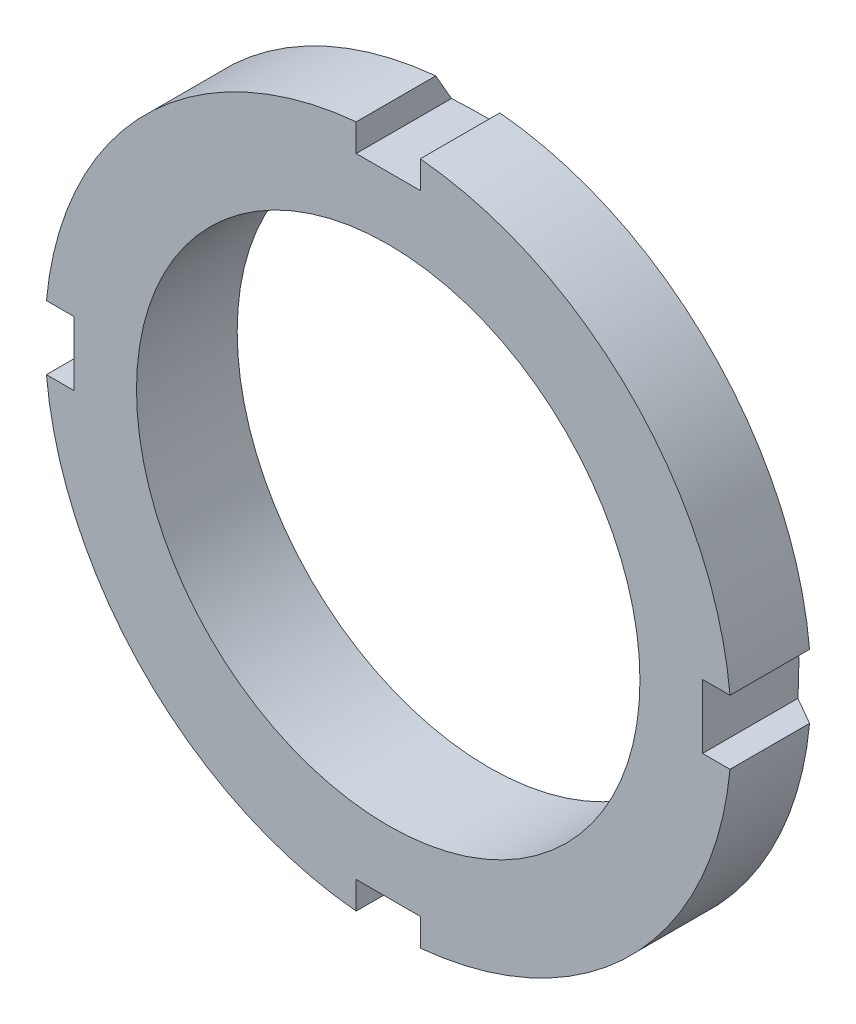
ISO-10303-21;
HEADER;
FILE_DESCRIPTION(('STEP AP214'),'2;1');
FILE_NAME('part.step','',(''),(''),'','','');
FILE_SCHEMA(('AUTOMOTIVE_DESIGN { 1 0 10303 214 1 1 1 1 }'));
ENDSEC;
DATA;
#1=APPLICATION_CONTEXT('core data for automotive mechanical design processes');
#2=APPLICATION_PROTOCOL_DEFINITION('international standard','automotive_design',2000,#1);
#3=PRODUCT_CONTEXT('',#1,'mechanical');
#4=PRODUCT('Part','Part','',(#3));
#5=PRODUCT_RELATED_PRODUCT_CATEGORY('part','',(#4));
#6=PRODUCT_DEFINITION_FORMATION('','',#4);
#7=PRODUCT_DEFINITION_CONTEXT('part definition',#1,'design');
#8=PRODUCT_DEFINITION('design','',#6,#7);
#9=PRODUCT_DEFINITION_SHAPE('','',#8);
#10=(LENGTH_UNIT() NAMED_UNIT(*) SI_UNIT(.MILLI.,.METRE.));
#11=(NAMED_UNIT(*) PLANE_ANGLE_UNIT() SI_UNIT($,.RADIAN.));
#12=(NAMED_UNIT(*) SI_UNIT($,.STERADIAN.) SOLID_ANGLE_UNIT());
#13=UNCERTAINTY_MEASURE_WITH_UNIT(LENGTH_MEASURE(1.E-05),#10,'distance_accuracy_value','');
#14=(GEOMETRIC_REPRESENTATION_CONTEXT(3) GLOBAL_UNCERTAINTY_ASSIGNED_CONTEXT((#13)) GLOBAL_UNIT_ASSIGNED_CONTEXT((#10,
#11,#12)) REPRESENTATION_CONTEXT('',''));
#15=CARTESIAN_POINT('',(0.,0.,0.));
#16=DIRECTION('',(0.,0.,1.));
#17=DIRECTION('',(1.,0.,0.));
#18=AXIS2_PLACEMENT_3D('',#15,#16,#17);
#19=CARTESIAN_POINT('',(0.,0.,0.));
#20=DIRECTION('',(0.,0.,-1.));
#21=DIRECTION('',(-1.,0.,0.));
#22=AXIS2_PLACEMENT_3D('',#19,#20,#21);
#23=CYLINDRICAL_SURFACE('',#22,37.5);
#24=DIRECTION('',(0.,0.,-1.));
#25=VECTOR('',#24,1.);
#26=CARTESIAN_POINT('',(-3.5,37.3363094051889,11.));
#27=LINE('',#26,#25);
#28=CARTESIAN_POINT('',(-3.5,37.3363094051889,11.));
#29=VERTEX_POINT('',#28);
#30=CARTESIAN_POINT('',(-3.5,37.3363094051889,2.30940107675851));
#31=VERTEX_POINT('',#30);
#32=EDGE_CURVE('E149',#29,#31,#27,.T.);
#33=ORIENTED_EDGE('',*,*,#32,.T.);
#34=CARTESIAN_POINT('',(0.,0.,2.30940107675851));
#35=DIRECTION('',(0.,0.,-1.));
#36=DIRECTION('',(-1.,0.,0.));
#37=AXIS2_PLACEMENT_3D('',#34,#35,#36);
#38=CIRCLE('',#37,37.5);
#39=CARTESIAN_POINT('',(-37.3363094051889,3.5,2.30940107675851));
#40=VERTEX_POINT('',#39);
#41=EDGE_CURVE('E186',#40,#31,#38,.T.);
#42=ORIENTED_EDGE('',*,*,#41,.F.);
#43=DIRECTION('',(0.,0.,-1.));
#44=VECTOR('',#43,1.);
#45=CARTESIAN_POINT('',(-37.3363094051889,3.5,11.));
#46=LINE('',#45,#44);
#47=CARTESIAN_POINT('',(-37.3363094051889,3.5,11.));
#48=VERTEX_POINT('',#47);
#49=EDGE_CURVE('E162',#48,#40,#46,.T.);
#50=ORIENTED_EDGE('',*,*,#49,.F.);
#51=CARTESIAN_POINT('',(0.,0.,11.));
#52=DIRECTION('',(0.,0.,-1.));
#53=DIRECTION('',(-1.,0.,0.));
#54=AXIS2_PLACEMENT_3D('',#51,#52,#53);
#55=CIRCLE('',#54,37.5);
#56=EDGE_CURVE('E169',#48,#29,#55,.T.);
#57=ORIENTED_EDGE('',*,*,#56,.T.);
#58=EDGE_LOOP('',(#33,#42,#50,#57));
#59=FACE_BOUND('',#58,.T.);
#60=ADVANCED_FACE('F33',(#59),#23,.T.);
#61=DIRECTION('',(0.,0.,-1.));
#62=VECTOR('',#61,1.);
#63=CARTESIAN_POINT('',(-37.3363094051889,-3.49999999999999,11.));
#64=LINE('',#63,#62);
#65=CARTESIAN_POINT('',(-37.3363094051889,-3.49999999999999,11.));
#66=VERTEX_POINT('',#65);
#67=CARTESIAN_POINT('',(-37.3363094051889,-3.5,2.30940107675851));
#68=VERTEX_POINT('',#67);
#69=EDGE_CURVE('E340',#66,#68,#64,.T.);
#70=ORIENTED_EDGE('',*,*,#69,.T.);
#71=CARTESIAN_POINT('',(-3.5,-37.3363094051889,2.30940107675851));
#72=VERTEX_POINT('',#71);
#73=EDGE_CURVE('E192',#72,#68,#38,.T.);
#74=ORIENTED_EDGE('',*,*,#73,.F.);
#75=DIRECTION('',(0.,0.,-1.));
#76=VECTOR('',#75,1.);
#77=CARTESIAN_POINT('',(-3.5,-37.3363094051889,11.));
#78=LINE('',#77,#76);
#79=CARTESIAN_POINT('',(-3.5,-37.3363094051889,11.));
#80=VERTEX_POINT('',#79);
#81=EDGE_CURVE('E314',#80,#72,#78,.T.);
#82=ORIENTED_EDGE('',*,*,#81,.F.);
#83=EDGE_CURVE('E179',#80,#66,#55,.T.);
#84=ORIENTED_EDGE('',*,*,#83,.T.);
#85=EDGE_LOOP('',(#70,#74,#82,#84));
#86=FACE_BOUND('',#85,.T.);
#87=ADVANCED_FACE('F395',(#86),#23,.T.);
#88=DIRECTION('',(0.,0.,-1.));
#89=VECTOR('',#88,1.);
#90=CARTESIAN_POINT('',(3.5,-37.3363094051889,11.));
#91=LINE('',#90,#89);
#92=CARTESIAN_POINT('',(3.5,-37.3363094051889,11.));
#93=VERTEX_POINT('',#92);
#94=CARTESIAN_POINT('',(3.5,-37.3363094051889,2.30940107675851));
#95=VERTEX_POINT('',#94);
#96=EDGE_CURVE('E330',#93,#95,#91,.T.);
#97=ORIENTED_EDGE('',*,*,#96,.T.);
#98=CARTESIAN_POINT('',(37.3363094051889,-3.5,2.30940107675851));
#99=VERTEX_POINT('',#98);
#100=EDGE_CURVE('E196',#99,#95,#38,.T.);
#101=ORIENTED_EDGE('',*,*,#100,.F.);
#102=DIRECTION('',(0.,0.,-1.));
#103=VECTOR('',#102,1.);
#104=CARTESIAN_POINT('',(37.3363094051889,-3.5,11.));
#105=LINE('',#104,#103);
#106=CARTESIAN_POINT('',(37.3363094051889,-3.5,11.));
#107=VERTEX_POINT('',#106);
#108=EDGE_CURVE('E328',#107,#99,#105,.T.);
#109=ORIENTED_EDGE('',*,*,#108,.F.);
#110=EDGE_CURVE('E183',#107,#93,#55,.T.);
#111=ORIENTED_EDGE('',*,*,#110,.T.);
#112=EDGE_LOOP('',(#97,#101,#109,#111));
#113=FACE_BOUND('',#112,.T.);
#114=ADVANCED_FACE('F327',(#113),#23,.T.);
#115=CARTESIAN_POINT('',(0.,0.,0.));
#116=DIRECTION('',(0.,0.,1.));
#117=DIRECTION('',(1.,0.,0.));
#118=AXIS2_PLACEMENT_3D('',#115,#116,#117);
#119=CONICAL_SURFACE('',#118,33.5,1.0471975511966);
#120=CARTESIAN_POINT('',(-43.0161307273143,3.5,5.57621303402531));
#121=CARTESIAN_POINT('',(-41.9810825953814,3.5,4.98059975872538));
#122=CARTESIAN_POINT('',(-40.9459765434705,3.5,4.38508710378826));
#123=CARTESIAN_POINT('',(-38.8756108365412,3.5,3.19432914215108));
#124=CARTESIAN_POINT('',(-37.8403511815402,3.5,2.5990838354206));
#125=CARTESIAN_POINT('',(-35.7696402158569,3.5,1.40892651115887));
#126=CARTESIAN_POINT('',(-34.7341889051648,3.5,0.814014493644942));
#127=CARTESIAN_POINT('',(-32.6630313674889,3.5,-0.375365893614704));
#128=CARTESIAN_POINT('',(-31.6273251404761,3.5,-0.969834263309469));
#129=CARTESIAN_POINT('',(-30.5914599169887,3.5,-1.56402557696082));
#130=B_SPLINE_CURVE_WITH_KNOTS('',3,(#120,#121,#122,#123,#124,#125,#126,#127,#128,#129),
.UNSPECIFIED.,.F.,.F.,(4,2,2,2,4),(0.,3.58255752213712,7.16511463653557,10.7476719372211,
14.3302296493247),.UNSPECIFIED.);
#131=CARTESIAN_POINT('',(-34.3363094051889,3.5,0.585566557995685));
#132=VERTEX_POINT('',#131);
#133=EDGE_CURVE('E235',#40,#132,#130,.T.);
#134=ORIENTED_EDGE('',*,*,#133,.F.);
#135=ORIENTED_EDGE('',*,*,#41,.T.);
#136=CARTESIAN_POINT('',(-3.5,28.3999857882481,-2.82044718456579));
#137=CARTESIAN_POINT('',(-3.5,29.4361144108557,-2.22671506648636));
#138=CARTESIAN_POINT('',(-3.5,30.4720463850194,-1.63263997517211));
#139=CARTESIAN_POINT('',(-3.5,32.5435987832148,-0.443947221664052));
#140=CARTESIAN_POINT('',(-3.5,33.5792192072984,0.150670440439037));
#141=CARTESIAN_POINT('',(-3.5,35.6502305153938,1.34030511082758));
#142=CARTESIAN_POINT('',(-3.5,36.6856213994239,1.935322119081));
#143=CARTESIAN_POINT('',(-3.5,38.7562213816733,3.12567275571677));
#144=CARTESIAN_POINT('',(-3.5,39.7914304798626,3.72100638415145));
#145=CARTESIAN_POINT('',(-3.5,40.826572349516,4.31645683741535));
#146=B_SPLINE_CURVE_WITH_KNOTS('',3,(#136,#137,#138,#139,#140,#141,#142,#143,#144,#145),
.UNSPECIFIED.,.F.,.F.,(4,2,2,2,4),(0.,3.58255797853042,7.16511535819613,10.7476724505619,
14.3302301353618),.UNSPECIFIED.);
#147=CARTESIAN_POINT('',(-3.5,34.3363094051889,0.585566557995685));
#148=VERTEX_POINT('',#147);
#149=EDGE_CURVE('E156',#148,#31,#146,.T.);
#150=ORIENTED_EDGE('',*,*,#149,.F.);
#151=CARTESIAN_POINT('',(11.7892823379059,34.3363094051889,1.61880193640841));
#152=CARTESIAN_POINT('',(11.1912515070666,34.3363094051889,1.50666255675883));
#153=CARTESIAN_POINT('',(10.5918088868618,34.3363094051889,1.40192016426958));
#154=CARTESIAN_POINT('',(9.39033927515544,34.3363094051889,1.20812451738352));
#155=CARTESIAN_POINT('',(8.78831204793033,34.3363094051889,1.11907272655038));
#156=CARTESIAN_POINT('',(7.58175696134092,34.3363094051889,0.957538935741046));
#157=CARTESIAN_POINT('',(6.97722811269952,34.3363094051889,0.88506429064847));
#158=CARTESIAN_POINT('',(5.76635058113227,34.3363094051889,0.757511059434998));
#159=CARTESIAN_POINT('',(5.16000195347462,34.3363094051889,0.702431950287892));
#160=CARTESIAN_POINT('',(3.95375504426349,34.3363094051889,0.610887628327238));
#161=CARTESIAN_POINT('',(3.35387432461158,34.3363094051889,0.574191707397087));
#162=CARTESIAN_POINT('',(2.15328381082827,34.3363094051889,0.518782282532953));
#163=CARTESIAN_POINT('',(1.55257402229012,34.3363094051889,0.500068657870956));
#164=CARTESIAN_POINT('',(0.351026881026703,34.3363094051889,0.480848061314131));
#165=CARTESIAN_POINT('',(-0.249810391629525,34.3363094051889,0.480336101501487));
#166=CARTESIAN_POINT('',(-1.45122219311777,34.3363094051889,0.497512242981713));
#167=CARTESIAN_POINT('',(-2.05179672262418,34.3363094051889,0.515200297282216));
#168=CARTESIAN_POINT('',(-3.25124663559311,34.3363094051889,0.568526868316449));
#169=CARTESIAN_POINT('',(-3.85012321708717,34.3363094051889,0.604138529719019));
#170=CARTESIAN_POINT('',(-5.04657261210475,34.3363094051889,0.692887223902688));
#171=CARTESIAN_POINT('',(-5.64414542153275,34.3363094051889,0.746024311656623));
#172=CARTESIAN_POINT('',(-6.83773000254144,34.3363094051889,0.869256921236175));
#173=CARTESIAN_POINT('',(-7.43374121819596,34.3363094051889,0.939357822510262));
#174=CARTESIAN_POINT('',(-8.62364124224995,34.3363094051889,1.09577109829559));
#175=CARTESIAN_POINT('',(-9.21752993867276,34.3363094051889,1.18208431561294));
#176=CARTESIAN_POINT('',(-11.011138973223,34.3363094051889,1.46657601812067));
#177=CARTESIAN_POINT('',(-12.2071508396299,34.3363094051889,1.68865570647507));
#178=CARTESIAN_POINT('',(-13.9917376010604,34.3363094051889,2.06315396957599));
#179=CARTESIAN_POINT('',(-14.5848093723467,34.3363094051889,2.19482657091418));
#180=CARTESIAN_POINT('',(-15.7679069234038,34.3363094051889,2.47096933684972));
#181=CARTESIAN_POINT('',(-16.3579330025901,34.3363094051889,2.61543821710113));
#182=CARTESIAN_POINT('',(-16.9464686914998,34.3363094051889,2.76581572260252));
#183=B_SPLINE_CURVE_WITH_KNOTS('',3,(#151,#152,#153,#154,#155,#156,#157,#158,#159,#160,#161,
#162,#163,#164,#165,#166,#167,#168,#169,#170,#171,#172,#173,#174,#175,#176,#177,#178,#179,#180,
#181,#182),.UNSPECIFIED.,.F.,.F.,(4,2,2,2,2,2,2,2,2,2,2,2,2,2,2,4),(0.,1.82535120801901,
3.65087258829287,5.47720234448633,7.30347718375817,9.10621914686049,10.9089490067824,
12.7111848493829,14.5134160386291,16.3129549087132,18.11249942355,19.9126153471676,
21.7128248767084,25.3603999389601,27.1828334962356,29.0050843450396),.UNSPECIFIED.);
#184=CARTESIAN_POINT('',(3.5,34.3363094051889,0.585566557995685));
#185=VERTEX_POINT('',#184);
#186=EDGE_CURVE('E249',#185,#148,#183,.T.);
#187=ORIENTED_EDGE('',*,*,#186,.F.);
#188=CARTESIAN_POINT('',(3.5,40.826572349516,4.31645683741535));
#189=CARTESIAN_POINT('',(3.5,39.7914304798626,3.72100638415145));
#190=CARTESIAN_POINT('',(3.5,38.7562213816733,3.12567275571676));
#191=CARTESIAN_POINT('',(3.5,36.6856213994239,1.935322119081));
#192=CARTESIAN_POINT('',(3.5,35.6502305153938,1.34030511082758));
#193=CARTESIAN_POINT('',(3.5,33.5792192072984,0.150670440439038));
#194=CARTESIAN_POINT('',(3.5,32.5435987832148,-0.443947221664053));
#195=CARTESIAN_POINT('',(3.5,30.4720463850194,-1.63263997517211));
#196=CARTESIAN_POINT('',(3.5,29.4361144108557,-2.22671506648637));
#197=CARTESIAN_POINT('',(3.5,28.3999857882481,-2.82044718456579));
#198=B_SPLINE_CURVE_WITH_KNOTS('',3,(#188,#189,#190,#191,#192,#193,#194,#195,#196,#197),
.UNSPECIFIED.,.F.,.F.,(4,2,2,2,4),(0.,3.5825576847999,7.16511477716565,10.7476721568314,
14.3302301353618),.UNSPECIFIED.);
#199=CARTESIAN_POINT('',(3.5,37.3363094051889,2.30940107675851));
#200=VERTEX_POINT('',#199);
#201=EDGE_CURVE('E161',#200,#185,#198,.T.);
#202=ORIENTED_EDGE('',*,*,#201,.F.);
#203=CARTESIAN_POINT('',(37.3363094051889,3.5,2.30940107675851));
#204=VERTEX_POINT('',#203);
#205=EDGE_CURVE('E191',#200,#204,#38,.T.);
#206=ORIENTED_EDGE('',*,*,#205,.T.);
#207=CARTESIAN_POINT('',(28.3999857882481,3.5,-2.82044718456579));
#208=CARTESIAN_POINT('',(29.4361144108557,3.5,-2.22671506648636));
#209=CARTESIAN_POINT('',(30.4720463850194,3.5,-1.63263997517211));
#210=CARTESIAN_POINT('',(32.5435987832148,3.5,-0.443947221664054));
#211=CARTESIAN_POINT('',(33.5792192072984,3.5,0.150670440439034));
#212=CARTESIAN_POINT('',(35.6502305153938,3.5,1.34030511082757));
#213=CARTESIAN_POINT('',(36.6856213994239,3.5,1.935322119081));
#214=CARTESIAN_POINT('',(38.7562213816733,3.5,3.12567275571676));
#215=CARTESIAN_POINT('',(39.7914304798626,3.5,3.72100638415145));
#216=CARTESIAN_POINT('',(40.826572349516,3.5,4.31645683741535));
#217=B_SPLINE_CURVE_WITH_KNOTS('',3,(#207,#208,#209,#210,#211,#212,#213,#214,#215,#216),
.UNSPECIFIED.,.F.,.F.,(4,2,2,2,4),(0.,3.58255797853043,7.16511535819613,10.7476724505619,
14.3302301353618),.UNSPECIFIED.);
#218=CARTESIAN_POINT('',(34.3363094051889,3.5,0.585566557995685));
#219=VERTEX_POINT('',#218);
#220=EDGE_CURVE('E275',#219,#204,#217,.T.);
#221=ORIENTED_EDGE('',*,*,#220,.F.);
#222=CARTESIAN_POINT('',(34.3363094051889,-16.9464686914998,2.76581572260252));
#223=CARTESIAN_POINT('',(34.3363094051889,-16.3579330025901,2.61543821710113));
#224=CARTESIAN_POINT('',(34.3363094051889,-15.7679069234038,2.47096933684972));
#225=CARTESIAN_POINT('',(34.3363094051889,-14.5848093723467,2.19482657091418));
#226=CARTESIAN_POINT('',(34.3363094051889,-13.9917376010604,2.06315396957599));
#227=CARTESIAN_POINT('',(34.3363094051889,-12.20715083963,1.68865570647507));
#228=CARTESIAN_POINT('',(34.3363094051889,-11.011138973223,1.46657601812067));
#229=CARTESIAN_POINT('',(34.3363094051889,-9.21752993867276,1.18208431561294));
#230=CARTESIAN_POINT('',(34.3363094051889,-8.62364124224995,1.09577109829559));
#231=CARTESIAN_POINT('',(34.3363094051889,-7.43374121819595,0.939357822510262));
#232=CARTESIAN_POINT('',(34.3363094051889,-6.83773000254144,0.869256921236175));
#233=CARTESIAN_POINT('',(34.3363094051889,-5.64414542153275,0.746024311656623));
#234=CARTESIAN_POINT('',(34.3363094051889,-5.04657261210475,0.692887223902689));
#235=CARTESIAN_POINT('',(34.3363094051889,-3.85012321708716,0.604138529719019));
#236=CARTESIAN_POINT('',(34.3363094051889,-3.2512466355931,0.568526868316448));
#237=CARTESIAN_POINT('',(34.3363094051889,-2.05179672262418,0.515200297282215));
#238=CARTESIAN_POINT('',(34.3363094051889,-1.45122219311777,0.497512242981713));
#239=CARTESIAN_POINT('',(34.3363094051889,-0.249810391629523,0.480336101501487));
#240=CARTESIAN_POINT('',(34.3363094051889,0.351026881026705,0.480848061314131));
#241=CARTESIAN_POINT('',(34.3363094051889,1.55257402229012,0.500068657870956));
#242=CARTESIAN_POINT('',(34.3363094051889,2.15328381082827,0.518782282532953));
#243=CARTESIAN_POINT('',(34.3363094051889,3.35387432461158,0.574191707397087));
#244=CARTESIAN_POINT('',(34.3363094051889,3.95375504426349,0.610887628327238));
#245=CARTESIAN_POINT('',(34.3363094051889,5.16000195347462,0.702431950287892));
#246=CARTESIAN_POINT('',(34.3363094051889,5.76635058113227,0.757511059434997));
#247=CARTESIAN_POINT('',(34.3363094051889,6.97722811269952,0.88506429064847));
#248=CARTESIAN_POINT('',(34.3363094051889,7.58175696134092,0.957538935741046));
#249=CARTESIAN_POINT('',(34.3363094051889,8.78831204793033,1.11907272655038));
#250=CARTESIAN_POINT('',(34.3363094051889,9.39033927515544,1.20812451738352));
#251=CARTESIAN_POINT('',(34.3363094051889,10.5918088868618,1.40192016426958));
#252=CARTESIAN_POINT('',(34.3363094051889,11.1912515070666,1.50666255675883));
#253=CARTESIAN_POINT('',(34.3363094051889,11.7892823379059,1.61880193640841));
#254=B_SPLINE_CURVE_WITH_KNOTS('',3,(#222,#223,#224,#225,#226,#227,#228,#229,#230,#231,#232,
#233,#234,#235,#236,#237,#238,#239,#240,#241,#242,#243,#244,#245,#246,#247,#248,#249,#250,#251,
#252,#253),.UNSPECIFIED.,.F.,.F.,(4,2,2,2,2,2,2,2,2,2,2,2,2,2,2,4),(0.,1.82225084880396,
3.64468440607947,7.29225946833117,9.09246899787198,10.8925849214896,12.6921294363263,
14.4916683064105,16.2938994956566,18.0961353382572,19.8988651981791,21.7016071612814,
23.5278820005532,25.3542117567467,27.1797331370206,29.0050843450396),.UNSPECIFIED.);
#255=CARTESIAN_POINT('',(34.3363094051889,-3.5,0.585566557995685));
#256=VERTEX_POINT('',#255);
#257=EDGE_CURVE('E207',#256,#219,#254,.T.);
#258=ORIENTED_EDGE('',*,*,#257,.F.);
#259=CARTESIAN_POINT('',(40.826572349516,-3.5,4.31645683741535));
#260=CARTESIAN_POINT('',(39.7914304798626,-3.5,3.72100638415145));
#261=CARTESIAN_POINT('',(38.7562213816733,-3.5,3.12567275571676));
#262=CARTESIAN_POINT('',(36.6856213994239,-3.5,1.935322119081));
#263=CARTESIAN_POINT('',(35.6502305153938,-3.5,1.34030511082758));
#264=CARTESIAN_POINT('',(33.5792192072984,-3.5,0.150670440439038));
#265=CARTESIAN_POINT('',(32.5435987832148,-3.5,-0.443947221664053));
#266=CARTESIAN_POINT('',(30.4720463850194,-3.5,-1.63263997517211));
#267=CARTESIAN_POINT('',(29.4361144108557,-3.5,-2.22671506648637));
#268=CARTESIAN_POINT('',(28.3999857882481,-3.5,-2.82044718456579));
#269=B_SPLINE_CURVE_WITH_KNOTS('',3,(#259,#260,#261,#262,#263,#264,#265,#266,#267,#268),
.UNSPECIFIED.,.F.,.F.,(4,2,2,2,4),(0.,3.5825576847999,7.16511477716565,10.7476721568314,
14.3302301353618),.UNSPECIFIED.);
#270=EDGE_CURVE('E281',#99,#256,#269,.T.);
#271=ORIENTED_EDGE('',*,*,#270,.F.);
#272=ORIENTED_EDGE('',*,*,#100,.T.);
#273=CARTESIAN_POINT('',(3.5,-30.5914599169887,-1.56402557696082));
#274=CARTESIAN_POINT('',(3.5,-31.6273251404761,-0.969834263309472));
#275=CARTESIAN_POINT('',(3.5,-32.6630313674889,-0.375365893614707));
#276=CARTESIAN_POINT('',(3.5,-34.7341889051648,0.814014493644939));
#277=CARTESIAN_POINT('',(3.5,-35.7696402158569,1.40892651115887));
#278=CARTESIAN_POINT('',(3.5,-37.8403511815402,2.5990838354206));
#279=CARTESIAN_POINT('',(3.5,-38.8756108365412,3.19432914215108));
#280=CARTESIAN_POINT('',(3.5,-40.9459765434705,4.38508710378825));
#281=CARTESIAN_POINT('',(3.5,-41.9810825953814,4.98059975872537));
#282=CARTESIAN_POINT('',(3.5,-43.0161307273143,5.57621303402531));
#283=B_SPLINE_CURVE_WITH_KNOTS('',3,(#273,#274,#275,#276,#277,#278,#279,#280,#281,#282),
.UNSPECIFIED.,.F.,.F.,(4,2,2,2,4),(0.,3.58255771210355,7.16511501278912,10.7476721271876,
14.3302296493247),.UNSPECIFIED.);
#284=CARTESIAN_POINT('',(3.5,-34.3363094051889,0.585566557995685));
#285=VERTEX_POINT('',#284);
#286=EDGE_CURVE('E57',#285,#95,#283,.T.);
#287=ORIENTED_EDGE('',*,*,#286,.F.);
#288=CARTESIAN_POINT('',(-16.9464686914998,-34.3363094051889,2.76581572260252));
#289=CARTESIAN_POINT('',(-16.3579330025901,-34.3363094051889,2.61543821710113));
#290=CARTESIAN_POINT('',(-15.7679069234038,-34.3363094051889,2.47096933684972));
#291=CARTESIAN_POINT('',(-14.5848093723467,-34.3363094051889,2.19482657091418));
#292=CARTESIAN_POINT('',(-13.9917376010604,-34.3363094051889,2.06315396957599));
#293=CARTESIAN_POINT('',(-12.20715083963,-34.3363094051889,1.68865570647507));
#294=CARTESIAN_POINT('',(-11.011138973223,-34.3363094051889,1.46657601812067));
#295=CARTESIAN_POINT('',(-9.21752993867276,-34.3363094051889,1.18208431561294));
#296=CARTESIAN_POINT('',(-8.62364124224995,-34.3363094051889,1.09577109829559));
#297=CARTESIAN_POINT('',(-7.43374121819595,-34.3363094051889,0.939357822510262));
#298=CARTESIAN_POINT('',(-6.83773000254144,-34.3363094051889,0.869256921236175));
#299=CARTESIAN_POINT('',(-5.64414542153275,-34.3363094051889,0.746024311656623));
#300=CARTESIAN_POINT('',(-5.04657261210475,-34.3363094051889,0.692887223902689));
#301=CARTESIAN_POINT('',(-3.85012321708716,-34.3363094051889,0.604138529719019));
#302=CARTESIAN_POINT('',(-3.2512466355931,-34.3363094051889,0.568526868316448));
#303=CARTESIAN_POINT('',(-2.05179672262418,-34.3363094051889,0.515200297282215));
#304=CARTESIAN_POINT('',(-1.45122219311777,-34.3363094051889,0.497512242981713));
#305=CARTESIAN_POINT('',(-0.249810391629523,-34.3363094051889,0.480336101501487));
#306=CARTESIAN_POINT('',(0.351026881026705,-34.3363094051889,0.480848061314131));
#307=CARTESIAN_POINT('',(1.55257402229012,-34.3363094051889,0.500068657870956));
#308=CARTESIAN_POINT('',(2.15328381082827,-34.3363094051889,0.518782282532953));
#309=CARTESIAN_POINT('',(3.35387432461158,-34.3363094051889,0.574191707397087));
#310=CARTESIAN_POINT('',(3.95375504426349,-34.3363094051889,0.610887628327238));
#311=CARTESIAN_POINT('',(5.16000195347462,-34.3363094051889,0.702431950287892));
#312=CARTESIAN_POINT('',(5.76635058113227,-34.3363094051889,0.757511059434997));
#313=CARTESIAN_POINT('',(6.97722811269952,-34.3363094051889,0.88506429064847));
#314=CARTESIAN_POINT('',(7.58175696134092,-34.3363094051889,0.957538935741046));
#315=CARTESIAN_POINT('',(8.78831204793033,-34.3363094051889,1.11907272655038));
#316=CARTESIAN_POINT('',(9.39033927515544,-34.3363094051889,1.20812451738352));
#317=CARTESIAN_POINT('',(10.5918088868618,-34.3363094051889,1.40192016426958));
#318=CARTESIAN_POINT('',(11.1912515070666,-34.3363094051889,1.50666255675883));
#319=CARTESIAN_POINT('',(11.7892823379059,-34.3363094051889,1.61880193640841));
#320=B_SPLINE_CURVE_WITH_KNOTS('',3,(#288,#289,#290,#291,#292,#293,#294,#295,#296,#297,#298,
#299,#300,#301,#302,#303,#304,#305,#306,#307,#308,#309,#310,#311,#312,#313,#314,#315,#316,#317,
#318,#319),.UNSPECIFIED.,.F.,.F.,(4,2,2,2,2,2,2,2,2,2,2,2,2,2,2,4),(0.,1.82225084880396,
3.64468440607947,7.29225946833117,9.09246899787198,10.8925849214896,12.6921294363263,
14.4916683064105,16.2938994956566,18.0961353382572,19.8988651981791,21.7016071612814,
23.5278820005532,25.3542117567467,27.1797331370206,29.0050843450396),.UNSPECIFIED.);
#321=CARTESIAN_POINT('',(-3.5,-34.3363094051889,0.585566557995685));
#322=VERTEX_POINT('',#321);
#323=EDGE_CURVE('E203',#322,#285,#320,.T.);
#324=ORIENTED_EDGE('',*,*,#323,.F.);
#325=CARTESIAN_POINT('',(-3.5,-43.0161307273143,5.57621303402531));
#326=CARTESIAN_POINT('',(-3.5,-41.9810825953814,4.98059975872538));
#327=CARTESIAN_POINT('',(-3.5,-40.9459765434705,4.38508710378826));
#328=CARTESIAN_POINT('',(-3.5,-38.8756108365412,3.19432914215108));
#329=CARTESIAN_POINT('',(-3.5,-37.8403511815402,2.5990838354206));
#330=CARTESIAN_POINT('',(-3.5,-35.7696402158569,1.40892651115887));
#331=CARTESIAN_POINT('',(-3.5,-34.7341889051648,0.814014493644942));
#332=CARTESIAN_POINT('',(-3.5,-32.6630313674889,-0.375365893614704));
#333=CARTESIAN_POINT('',(-3.5,-31.6273251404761,-0.969834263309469));
#334=CARTESIAN_POINT('',(-3.5,-30.5914599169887,-1.56402557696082));
#335=B_SPLINE_CURVE_WITH_KNOTS('',3,(#325,#326,#327,#328,#329,#330,#331,#332,#333,#334),
.UNSPECIFIED.,.F.,.F.,(4,2,2,2,4),(0.,3.58255752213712,7.16511463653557,10.7476719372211,
14.3302296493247),.UNSPECIFIED.);
#336=EDGE_CURVE('E307',#72,#322,#335,.T.);
#337=ORIENTED_EDGE('',*,*,#336,.F.);
#338=ORIENTED_EDGE('',*,*,#73,.T.);
#339=CARTESIAN_POINT('',(-30.5914599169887,-3.5,-1.56402557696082));
#340=CARTESIAN_POINT('',(-31.6273251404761,-3.5,-0.969834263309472));
#341=CARTESIAN_POINT('',(-32.6630313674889,-3.5,-0.375365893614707));
#342=CARTESIAN_POINT('',(-34.7341889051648,-3.5,0.814014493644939));
#343=CARTESIAN_POINT('',(-35.7696402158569,-3.5,1.40892651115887));
#344=CARTESIAN_POINT('',(-37.8403511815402,-3.5,2.5990838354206));
#345=CARTESIAN_POINT('',(-38.8756108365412,-3.5,3.19432914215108));
#346=CARTESIAN_POINT('',(-40.9459765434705,-3.5,4.38508710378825));
#347=CARTESIAN_POINT('',(-41.9810825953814,-3.5,4.98059975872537));
#348=CARTESIAN_POINT('',(-43.0161307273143,-3.5,5.57621303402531));
#349=B_SPLINE_CURVE_WITH_KNOTS('',3,(#339,#340,#341,#342,#343,#344,#345,#346,#347,#348),
.UNSPECIFIED.,.F.,.F.,(4,2,2,2,4),(0.,3.58255771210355,7.16511501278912,10.7476721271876,
14.3302296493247),.UNSPECIFIED.);
#350=CARTESIAN_POINT('',(-34.3363094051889,-3.5,0.585566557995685));
#351=VERTEX_POINT('',#350);
#352=EDGE_CURVE('E49',#351,#68,#349,.T.);
#353=ORIENTED_EDGE('',*,*,#352,.F.);
#354=CARTESIAN_POINT('',(-34.3363094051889,11.7892823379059,1.61880193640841));
#355=CARTESIAN_POINT('',(-34.3363094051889,11.1912515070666,1.50666255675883));
#356=CARTESIAN_POINT('',(-34.3363094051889,10.5918088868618,1.40192016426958));
#357=CARTESIAN_POINT('',(-34.3363094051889,9.39033927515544,1.20812451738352));
#358=CARTESIAN_POINT('',(-34.3363094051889,8.78831204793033,1.11907272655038));
#359=CARTESIAN_POINT('',(-34.3363094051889,7.58175696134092,0.957538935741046));
#360=CARTESIAN_POINT('',(-34.3363094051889,6.97722811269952,0.88506429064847));
#361=CARTESIAN_POINT('',(-34.3363094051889,5.76635058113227,0.757511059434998));
#362=CARTESIAN_POINT('',(-34.3363094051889,5.16000195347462,0.702431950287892));
#363=CARTESIAN_POINT('',(-34.3363094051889,3.95375504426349,0.610887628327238));
#364=CARTESIAN_POINT('',(-34.3363094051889,3.35387432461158,0.574191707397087));
#365=CARTESIAN_POINT('',(-34.3363094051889,2.15328381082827,0.518782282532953));
#366=CARTESIAN_POINT('',(-34.3363094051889,1.55257402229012,0.500068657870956));
#367=CARTESIAN_POINT('',(-34.3363094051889,0.351026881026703,0.480848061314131));
#368=CARTESIAN_POINT('',(-34.3363094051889,-0.249810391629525,0.480336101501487));
#369=CARTESIAN_POINT('',(-34.3363094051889,-1.45122219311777,0.497512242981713));
#370=CARTESIAN_POINT('',(-34.3363094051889,-2.05179672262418,0.515200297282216));
#371=CARTESIAN_POINT('',(-34.3363094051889,-3.25124663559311,0.568526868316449));
#372=CARTESIAN_POINT('',(-34.3363094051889,-3.85012321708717,0.604138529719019));
#373=CARTESIAN_POINT('',(-34.3363094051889,-5.04657261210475,0.692887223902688));
#374=CARTESIAN_POINT('',(-34.3363094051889,-5.64414542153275,0.746024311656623));
#375=CARTESIAN_POINT('',(-34.3363094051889,-6.83773000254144,0.869256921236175));
#376=CARTESIAN_POINT('',(-34.3363094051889,-7.43374121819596,0.939357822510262));
#377=CARTESIAN_POINT('',(-34.3363094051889,-8.62364124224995,1.09577109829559));
#378=CARTESIAN_POINT('',(-34.3363094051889,-9.21752993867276,1.18208431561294));
#379=CARTESIAN_POINT('',(-34.3363094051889,-11.011138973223,1.46657601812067));
#380=CARTESIAN_POINT('',(-34.3363094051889,-12.2071508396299,1.68865570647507));
#381=CARTESIAN_POINT('',(-34.3363094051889,-13.9917376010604,2.06315396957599));
#382=CARTESIAN_POINT('',(-34.3363094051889,-14.5848093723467,2.19482657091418));
#383=CARTESIAN_POINT('',(-34.3363094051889,-15.7679069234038,2.47096933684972));
#384=CARTESIAN_POINT('',(-34.3363094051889,-16.3579330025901,2.61543821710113));
#385=CARTESIAN_POINT('',(-34.3363094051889,-16.9464686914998,2.76581572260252));
#386=B_SPLINE_CURVE_WITH_KNOTS('',3,(#354,#355,#356,#357,#358,#359,#360,#361,#362,#363,#364,
#365,#366,#367,#368,#369,#370,#371,#372,#373,#374,#375,#376,#377,#378,#379,#380,#381,#382,#383,
#384,#385),.UNSPECIFIED.,.F.,.F.,(4,2,2,2,2,2,2,2,2,2,2,2,2,2,2,4),(0.,1.82535120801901,
3.65087258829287,5.47720234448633,7.30347718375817,9.10621914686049,10.9089490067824,
12.7111848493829,14.5134160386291,16.3129549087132,18.11249942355,19.9126153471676,
21.7128248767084,25.3603999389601,27.1828334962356,29.0050843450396),.UNSPECIFIED.);
#387=EDGE_CURVE('E199',#132,#351,#386,.T.);
#388=ORIENTED_EDGE('',*,*,#387,.F.);
#389=EDGE_LOOP('',(#134,#135,#150,#187,#202,#206,#221,#258,#271,#272,#287,#324,#337,#338,#353,#388));
#390=FACE_BOUND('',#389,.T.);
#391=CARTESIAN_POINT('',(0.,0.,0.));
#392=DIRECTION('',(0.,0.,-1.));
#393=DIRECTION('',(-1.,0.,0.));
#394=AXIS2_PLACEMENT_3D('',#391,#392,#393);
#395=CIRCLE('',#394,33.5);
#396=CARTESIAN_POINT('',(-33.5,0.,0.));
#397=VERTEX_POINT('',#396);
#398=EDGE_CURVE('E11',#397,#397,#395,.T.);
#399=ORIENTED_EDGE('',*,*,#398,.F.);
#400=EDGE_LOOP('',(#399));
#401=FACE_BOUND('',#400,.T.);
#402=ADVANCED_FACE('F35',(#390,#401),#119,.T.);
#403=CARTESIAN_POINT('',(0.,27.5,0.));
#404=DIRECTION('',(0.,0.,-1.));
#405=DIRECTION('',(-1.,0.,0.));
#406=AXIS2_PLACEMENT_3D('',#403,#404,#405);
#407=PLANE('',#406);
#408=ORIENTED_EDGE('',*,*,#398,.T.);
#409=EDGE_LOOP('',(#408));
#410=FACE_BOUND('',#409,.T.);
#411=CARTESIAN_POINT('',(0.,0.,0.));
#412=DIRECTION('',(0.,0.,-1.));
#413=DIRECTION('',(-1.,0.,0.));
#414=AXIS2_PLACEMENT_3D('',#411,#412,#413);
#415=CIRCLE('',#414,27.5);
#416=CARTESIAN_POINT('',(-27.5,0.,0.));
#417=VERTEX_POINT('',#416);
#418=EDGE_CURVE('E42',#417,#417,#415,.T.);
#419=ORIENTED_EDGE('',*,*,#418,.F.);
#420=EDGE_LOOP('',(#419));
#421=FACE_BOUND('',#420,.T.);
#422=ADVANCED_FACE('F415',(#410,#421),#407,.T.);
#423=CARTESIAN_POINT('',(0.,0.,0.));
#424=DIRECTION('',(0.,0.,-1.));
#425=DIRECTION('',(-1.,0.,0.));
#426=AXIS2_PLACEMENT_3D('',#423,#424,#425);
#427=CYLINDRICAL_SURFACE('',#426,27.5);
#428=ORIENTED_EDGE('',*,*,#418,.T.);
#429=EDGE_LOOP('',(#428));
#430=FACE_BOUND('',#429,.T.);
#431=CARTESIAN_POINT('',(0.,0.,11.));
#432=DIRECTION('',(0.,0.,-1.));
#433=DIRECTION('',(-1.,0.,0.));
#434=AXIS2_PLACEMENT_3D('',#431,#432,#433);
#435=CIRCLE('',#434,27.5);
#436=CARTESIAN_POINT('',(-27.5,0.,11.));
#437=VERTEX_POINT('',#436);
#438=EDGE_CURVE('E176',#437,#437,#435,.T.);
#439=ORIENTED_EDGE('',*,*,#438,.F.);
#440=EDGE_LOOP('',(#439));
#441=FACE_BOUND('',#440,.T.);
#442=ADVANCED_FACE('F410',(#430,#441),#427,.F.);
#443=CARTESIAN_POINT('',(0.,37.5,11.));
#444=DIRECTION('',(0.,0.,1.));
#445=DIRECTION('',(1.,0.,0.));
#446=AXIS2_PLACEMENT_3D('',#443,#444,#445);
#447=PLANE('',#446);
#448=DIRECTION('',(1.,0.,0.));
#449=VECTOR('',#448,1.);
#450=CARTESIAN_POINT('',(-34.3363094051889,3.5,11.));
#451=LINE('',#450,#449);
#452=CARTESIAN_POINT('',(-34.3363094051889,3.5,11.));
#453=VERTEX_POINT('',#452);
#454=EDGE_CURVE('E173',#48,#453,#451,.T.);
#455=ORIENTED_EDGE('',*,*,#454,.T.);
#456=DIRECTION('',(0.,-1.,0.));
#457=VECTOR('',#456,1.);
#458=CARTESIAN_POINT('',(-34.3363094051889,3.5,11.));
#459=LINE('',#458,#457);
#460=CARTESIAN_POINT('',(-34.3363094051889,-3.5,11.));
#461=VERTEX_POINT('',#460);
#462=EDGE_CURVE('E347',#453,#461,#459,.T.);
#463=ORIENTED_EDGE('',*,*,#462,.T.);
#464=DIRECTION('',(-1.,0.,0.));
#465=VECTOR('',#464,1.);
#466=CARTESIAN_POINT('',(-34.3363094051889,-3.5,11.));
#467=LINE('',#466,#465);
#468=EDGE_CURVE('E349',#461,#66,#467,.T.);
#469=ORIENTED_EDGE('',*,*,#468,.T.);
#470=ORIENTED_EDGE('',*,*,#83,.F.);
#471=DIRECTION('',(0.,1.,0.));
#472=VECTOR('',#471,1.);
#473=CARTESIAN_POINT('',(-3.5,-34.3363094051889,11.));
#474=LINE('',#473,#472);
#475=CARTESIAN_POINT('',(-3.5,-34.3363094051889,11.));
#476=VERTEX_POINT('',#475);
#477=EDGE_CURVE('E354',#80,#476,#474,.T.);
#478=ORIENTED_EDGE('',*,*,#477,.T.);
#479=DIRECTION('',(1.,0.,0.));
#480=VECTOR('',#479,1.);
#481=CARTESIAN_POINT('',(-3.5,-34.3363094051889,11.));
#482=LINE('',#481,#480);
#483=CARTESIAN_POINT('',(3.5,-34.3363094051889,11.));
#484=VERTEX_POINT('',#483);
#485=EDGE_CURVE('E317',#476,#484,#482,.T.);
#486=ORIENTED_EDGE('',*,*,#485,.T.);
#487=DIRECTION('',(0.,-1.,0.));
#488=VECTOR('',#487,1.);
#489=CARTESIAN_POINT('',(3.5,-34.3363094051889,11.));
#490=LINE('',#489,#488);
#491=EDGE_CURVE('E357',#484,#93,#490,.T.);
#492=ORIENTED_EDGE('',*,*,#491,.T.);
#493=ORIENTED_EDGE('',*,*,#110,.F.);
#494=DIRECTION('',(-1.,0.,0.));
#495=VECTOR('',#494,1.);
#496=CARTESIAN_POINT('',(34.3363094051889,-3.5,11.));
#497=LINE('',#496,#495);
#498=CARTESIAN_POINT('',(34.3363094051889,-3.5,11.));
#499=VERTEX_POINT('',#498);
#500=EDGE_CURVE('E359',#107,#499,#497,.T.);
#501=ORIENTED_EDGE('',*,*,#500,.T.);
#502=DIRECTION('',(0.,1.,0.));
#503=VECTOR('',#502,1.);
#504=CARTESIAN_POINT('',(34.3363094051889,3.5,11.));
#505=LINE('',#504,#503);
#506=CARTESIAN_POINT('',(34.3363094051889,3.5,11.));
#507=VERTEX_POINT('',#506);
#508=EDGE_CURVE('E362',#499,#507,#505,.T.);
#509=ORIENTED_EDGE('',*,*,#508,.T.);
#510=DIRECTION('',(1.,0.,0.));
#511=VECTOR('',#510,1.);
#512=CARTESIAN_POINT('',(34.3363094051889,3.5,11.));
#513=LINE('',#512,#511);
#514=CARTESIAN_POINT('',(37.3363094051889,3.5,11.));
#515=VERTEX_POINT('',#514);
#516=EDGE_CURVE('E365',#507,#515,#513,.T.);
#517=ORIENTED_EDGE('',*,*,#516,.T.);
#518=CARTESIAN_POINT('',(3.5,37.3363094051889,11.));
#519=VERTEX_POINT('',#518);
#520=EDGE_CURVE('E177',#519,#515,#55,.T.);
#521=ORIENTED_EDGE('',*,*,#520,.F.);
#522=DIRECTION('',(0.,-1.,0.));
#523=VECTOR('',#522,1.);
#524=CARTESIAN_POINT('',(3.5,34.3363094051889,11.));
#525=LINE('',#524,#523);
#526=CARTESIAN_POINT('',(3.5,34.3363094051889,11.));
#527=VERTEX_POINT('',#526);
#528=EDGE_CURVE('E368',#519,#527,#525,.T.);
#529=ORIENTED_EDGE('',*,*,#528,.T.);
#530=DIRECTION('',(-1.,0.,0.));
#531=VECTOR('',#530,1.);
#532=CARTESIAN_POINT('',(-3.5,34.3363094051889,11.));
#533=LINE('',#532,#531);
#534=CARTESIAN_POINT('',(-3.5,34.3363094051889,11.));
#535=VERTEX_POINT('',#534);
#536=EDGE_CURVE('E172',#527,#535,#533,.T.);
#537=ORIENTED_EDGE('',*,*,#536,.T.);
#538=DIRECTION('',(0.,1.,0.));
#539=VECTOR('',#538,1.);
#540=CARTESIAN_POINT('',(-3.5,34.3363094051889,11.));
#541=LINE('',#540,#539);
#542=EDGE_CURVE('E153',#535,#29,#541,.T.);
#543=ORIENTED_EDGE('',*,*,#542,.T.);
#544=ORIENTED_EDGE('',*,*,#56,.F.);
#545=EDGE_LOOP('',(#455,#463,#469,#470,#478,#486,#492,#493,#501,#509,#517,#521,#529,#537,#543,#544));
#546=FACE_BOUND('',#545,.T.);
#547=ORIENTED_EDGE('',*,*,#438,.T.);
#548=EDGE_LOOP('',(#547));
#549=FACE_BOUND('',#548,.T.);
#550=ADVANCED_FACE('F167',(#546,#549),#447,.T.);
#551=DIRECTION('',(0.,0.,-1.));
#552=VECTOR('',#551,1.);
#553=CARTESIAN_POINT('',(37.3363094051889,3.5,11.));
#554=LINE('',#553,#552);
#555=EDGE_CURVE('E378',#515,#204,#554,.T.);
#556=ORIENTED_EDGE('',*,*,#555,.T.);
#557=ORIENTED_EDGE('',*,*,#205,.F.);
#558=DIRECTION('',(0.,0.,-1.));
#559=VECTOR('',#558,1.);
#560=CARTESIAN_POINT('',(3.5,37.3363094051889,11.));
#561=LINE('',#560,#559);
#562=EDGE_CURVE('E376',#519,#200,#561,.T.);
#563=ORIENTED_EDGE('',*,*,#562,.F.);
#564=ORIENTED_EDGE('',*,*,#520,.T.);
#565=EDGE_LOOP('',(#556,#557,#563,#564));
#566=FACE_BOUND('',#565,.T.);
#567=ADVANCED_FACE('F392',(#566),#23,.T.);
#568=CARTESIAN_POINT('',(-3.5,34.3363094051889,11.));
#569=DIRECTION('',(-1.,0.,0.));
#570=DIRECTION('',(0.,0.,1.));
#571=AXIS2_PLACEMENT_3D('',#568,#569,#570);
#572=PLANE('',#571);
#573=ORIENTED_EDGE('',*,*,#149,.T.);
#574=ORIENTED_EDGE('',*,*,#32,.F.);
#575=ORIENTED_EDGE('',*,*,#542,.F.);
#576=DIRECTION('',(0.,0.,-1.));
#577=VECTOR('',#576,1.);
#578=CARTESIAN_POINT('',(-3.5,34.3363094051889,11.));
#579=LINE('',#578,#577);
#580=EDGE_CURVE('E371',#535,#148,#579,.T.);
#581=ORIENTED_EDGE('',*,*,#580,.T.);
#582=EDGE_LOOP('',(#573,#574,#575,#581));
#583=FACE_BOUND('',#582,.T.);
#584=ADVANCED_FACE('F151',(#583),#572,.F.);
#585=CARTESIAN_POINT('',(3.5,34.3363094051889,11.));
#586=DIRECTION('',(1.,0.,0.));
#587=DIRECTION('',(0.,0.,-1.));
#588=AXIS2_PLACEMENT_3D('',#585,#586,#587);
#589=PLANE('',#588);
#590=ORIENTED_EDGE('',*,*,#201,.T.);
#591=DIRECTION('',(0.,0.,-1.));
#592=VECTOR('',#591,1.);
#593=CARTESIAN_POINT('',(3.5,34.3363094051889,11.));
#594=LINE('',#593,#592);
#595=EDGE_CURVE('E373',#527,#185,#594,.T.);
#596=ORIENTED_EDGE('',*,*,#595,.F.);
#597=ORIENTED_EDGE('',*,*,#528,.F.);
#598=ORIENTED_EDGE('',*,*,#562,.T.);
#599=EDGE_LOOP('',(#590,#596,#597,#598));
#600=FACE_BOUND('',#599,.T.);
#601=ADVANCED_FACE('F263',(#600),#589,.F.);
#602=CARTESIAN_POINT('',(-3.5,34.3363094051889,11.));
#603=DIRECTION('',(0.,-1.,0.));
#604=DIRECTION('',(0.,0.,-1.));
#605=AXIS2_PLACEMENT_3D('',#602,#603,#604);
#606=PLANE('',#605);
#607=ORIENTED_EDGE('',*,*,#186,.T.);
#608=ORIENTED_EDGE('',*,*,#580,.F.);
#609=ORIENTED_EDGE('',*,*,#536,.F.);
#610=ORIENTED_EDGE('',*,*,#595,.T.);
#611=EDGE_LOOP('',(#607,#608,#609,#610));
#612=FACE_BOUND('',#611,.T.);
#613=ADVANCED_FACE('F258',(#612),#606,.F.);
#614=CARTESIAN_POINT('',(34.3363094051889,3.5,11.));
#615=DIRECTION('',(0.,1.,0.));
#616=DIRECTION('',(0.,0.,1.));
#617=AXIS2_PLACEMENT_3D('',#614,#615,#616);
#618=PLANE('',#617);
#619=ORIENTED_EDGE('',*,*,#220,.T.);
#620=ORIENTED_EDGE('',*,*,#555,.F.);
#621=ORIENTED_EDGE('',*,*,#516,.F.);
#622=DIRECTION('',(0.,0.,-1.));
#623=VECTOR('',#622,1.);
#624=CARTESIAN_POINT('',(34.3363094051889,3.5,11.));
#625=LINE('',#624,#623);
#626=EDGE_CURVE('E381',#507,#219,#625,.T.);
#627=ORIENTED_EDGE('',*,*,#626,.T.);
#628=EDGE_LOOP('',(#619,#620,#621,#627));
#629=FACE_BOUND('',#628,.T.);
#630=ADVANCED_FACE('F262',(#629),#618,.F.);
#631=CARTESIAN_POINT('',(34.3363094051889,-3.5,11.));
#632=DIRECTION('',(0.,-1.,0.));
#633=DIRECTION('',(0.,0.,-1.));
#634=AXIS2_PLACEMENT_3D('',#631,#632,#633);
#635=PLANE('',#634);
#636=ORIENTED_EDGE('',*,*,#270,.T.);
#637=DIRECTION('',(0.,0.,-1.));
#638=VECTOR('',#637,1.);
#639=CARTESIAN_POINT('',(34.3363094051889,-3.5,11.));
#640=LINE('',#639,#638);
#641=EDGE_CURVE('E335',#499,#256,#640,.T.);
#642=ORIENTED_EDGE('',*,*,#641,.F.);
#643=ORIENTED_EDGE('',*,*,#500,.F.);
#644=ORIENTED_EDGE('',*,*,#108,.T.);
#645=EDGE_LOOP('',(#636,#642,#643,#644));
#646=FACE_BOUND('',#645,.T.);
#647=ADVANCED_FACE('F291',(#646),#635,.F.);
#648=CARTESIAN_POINT('',(34.3363094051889,3.5,11.));
#649=DIRECTION('',(-1.,0.,0.));
#650=DIRECTION('',(0.,0.,1.));
#651=AXIS2_PLACEMENT_3D('',#648,#649,#650);
#652=PLANE('',#651);
#653=ORIENTED_EDGE('',*,*,#257,.T.);
#654=ORIENTED_EDGE('',*,*,#626,.F.);
#655=ORIENTED_EDGE('',*,*,#508,.F.);
#656=ORIENTED_EDGE('',*,*,#641,.T.);
#657=EDGE_LOOP('',(#653,#654,#655,#656));
#658=FACE_BOUND('',#657,.T.);
#659=ADVANCED_FACE('F294',(#658),#652,.F.);
#660=CARTESIAN_POINT('',(3.5,-34.3363094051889,11.));
#661=DIRECTION('',(1.,0.,0.));
#662=DIRECTION('',(0.,0.,-1.));
#663=AXIS2_PLACEMENT_3D('',#660,#661,#662);
#664=PLANE('',#663);
#665=ORIENTED_EDGE('',*,*,#286,.T.);
#666=ORIENTED_EDGE('',*,*,#96,.F.);
#667=ORIENTED_EDGE('',*,*,#491,.F.);
#668=DIRECTION('',(0.,0.,-1.));
#669=VECTOR('',#668,1.);
#670=CARTESIAN_POINT('',(3.5,-34.3363094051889,11.));
#671=LINE('',#670,#669);
#672=EDGE_CURVE('E319',#484,#285,#671,.T.);
#673=ORIENTED_EDGE('',*,*,#672,.T.);
#674=EDGE_LOOP('',(#665,#666,#667,#673));
#675=FACE_BOUND('',#674,.T.);
#676=ADVANCED_FACE('F297',(#675),#664,.F.);
#677=CARTESIAN_POINT('',(-3.5,-34.3363094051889,11.));
#678=DIRECTION('',(-1.,0.,0.));
#679=DIRECTION('',(0.,0.,1.));
#680=AXIS2_PLACEMENT_3D('',#677,#678,#679);
#681=PLANE('',#680);
#682=ORIENTED_EDGE('',*,*,#336,.T.);
#683=DIRECTION('',(0.,0.,-1.));
#684=VECTOR('',#683,1.);
#685=CARTESIAN_POINT('',(-3.5,-34.3363094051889,11.));
#686=LINE('',#685,#684);
#687=EDGE_CURVE('E312',#476,#322,#686,.T.);
#688=ORIENTED_EDGE('',*,*,#687,.F.);
#689=ORIENTED_EDGE('',*,*,#477,.F.);
#690=ORIENTED_EDGE('',*,*,#81,.T.);
#691=EDGE_LOOP('',(#682,#688,#689,#690));
#692=FACE_BOUND('',#691,.T.);
#693=ADVANCED_FACE('F300',(#692),#681,.F.);
#694=CARTESIAN_POINT('',(-3.5,-34.3363094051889,11.));
#695=DIRECTION('',(0.,1.,0.));
#696=DIRECTION('',(0.,0.,1.));
#697=AXIS2_PLACEMENT_3D('',#694,#695,#696);
#698=PLANE('',#697);
#699=ORIENTED_EDGE('',*,*,#323,.T.);
#700=ORIENTED_EDGE('',*,*,#672,.F.);
#701=ORIENTED_EDGE('',*,*,#485,.F.);
#702=ORIENTED_EDGE('',*,*,#687,.T.);
#703=EDGE_LOOP('',(#699,#700,#701,#702));
#704=FACE_BOUND('',#703,.T.);
#705=ADVANCED_FACE('F230',(#704),#698,.F.);
#706=CARTESIAN_POINT('',(-34.3363094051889,3.5,11.));
#707=DIRECTION('',(0.,1.,0.));
#708=DIRECTION('',(0.,0.,1.));
#709=AXIS2_PLACEMENT_3D('',#706,#707,#708);
#710=PLANE('',#709);
#711=ORIENTED_EDGE('',*,*,#133,.T.);
#712=DIRECTION('',(0.,0.,-1.));
#713=VECTOR('',#712,1.);
#714=CARTESIAN_POINT('',(-34.3363094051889,3.5,11.));
#715=LINE('',#714,#713);
#716=EDGE_CURVE('E344',#453,#132,#715,.T.);
#717=ORIENTED_EDGE('',*,*,#716,.F.);
#718=ORIENTED_EDGE('',*,*,#454,.F.);
#719=ORIENTED_EDGE('',*,*,#49,.T.);
#720=EDGE_LOOP('',(#711,#717,#718,#719));
#721=FACE_BOUND('',#720,.T.);
#722=ADVANCED_FACE('F224',(#721),#710,.F.);
#723=CARTESIAN_POINT('',(-34.3363094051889,3.5,11.));
#724=DIRECTION('',(1.,0.,0.));
#725=DIRECTION('',(0.,0.,-1.));
#726=AXIS2_PLACEMENT_3D('',#723,#724,#725);
#727=PLANE('',#726);
#728=ORIENTED_EDGE('',*,*,#387,.T.);
#729=DIRECTION('',(0.,0.,-1.));
#730=VECTOR('',#729,1.);
#731=CARTESIAN_POINT('',(-34.3363094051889,-3.5,11.));
#732=LINE('',#731,#730);
#733=EDGE_CURVE('E342',#461,#351,#732,.T.);
#734=ORIENTED_EDGE('',*,*,#733,.F.);
#735=ORIENTED_EDGE('',*,*,#462,.F.);
#736=ORIENTED_EDGE('',*,*,#716,.T.);
#737=EDGE_LOOP('',(#728,#734,#735,#736));
#738=FACE_BOUND('',#737,.T.);
#739=ADVANCED_FACE('F218',(#738),#727,.F.);
#740=CARTESIAN_POINT('',(-34.3363094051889,-3.5,11.));
#741=DIRECTION('',(0.,-1.,0.));
#742=DIRECTION('',(0.,0.,-1.));
#743=AXIS2_PLACEMENT_3D('',#740,#741,#742);
#744=PLANE('',#743);
#745=ORIENTED_EDGE('',*,*,#352,.T.);
#746=ORIENTED_EDGE('',*,*,#69,.F.);
#747=ORIENTED_EDGE('',*,*,#468,.F.);
#748=ORIENTED_EDGE('',*,*,#733,.T.);
#749=EDGE_LOOP('',(#745,#746,#747,#748));
#750=FACE_BOUND('',#749,.T.);
#751=ADVANCED_FACE('F223',(#750),#744,.F.);
#752=CLOSED_SHELL('',(#60,#87,#114,#402,#422,#442,#550,#567,#584,#601,#613,#630,#647,#659,#676,
#693,#705,#722,#739,#751));
#753=MANIFOLD_SOLID_BREP('B2',#752);
#754=ADVANCED_BREP_SHAPE_REPRESENTATION('',(#18,#753),#14);
#755=SHAPE_DEFINITION_REPRESENTATION(#9,#754);
ENDSEC;
END-ISO-10303-21;
